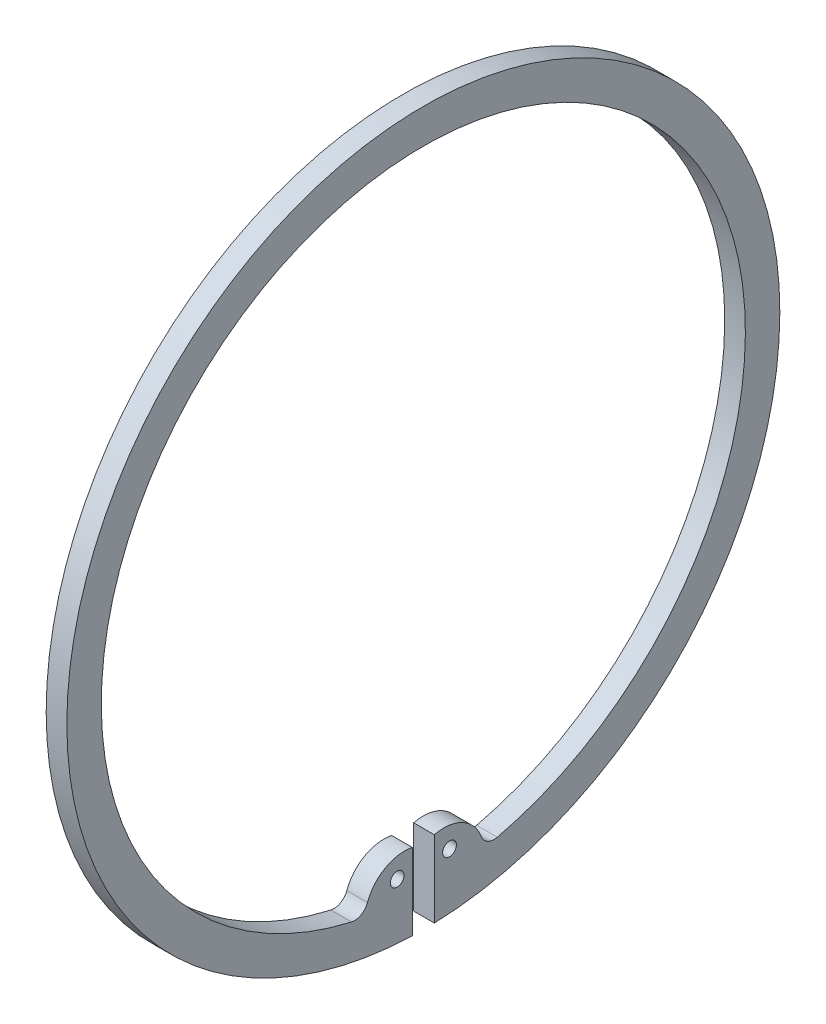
from build123d import *

# Parameters (mm, degrees)
ESQUISSE1_R          = 1
BASE_EXTRUSION_DEPTH = 3


with BuildPart() as part:
    # Esquisse1 → Base-Extrusion (new body)
    with BuildSketch(Plane(origin=(0, 0, 0), x_dir=(0, 0, -1), z_dir=(1, 0, 0))):
        with BuildLine():
            Line((-1.6, -51.725259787), (-1.6, -40.609160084))
            ThreePointArc((-1.6, -40.609160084), (-5.538478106, -41.242641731), (-8.107128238, -44.29468126))
            ThreePointArc((-8.107128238, -44.29468126), (-9.029600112, -45.374888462), (-10.436607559, -45.570162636))
            ThreePointArc((-10.436607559, -45.570162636), (-0.156480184, 46.749738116), (10.741434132, -45.499275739))
            ThreePointArc((10.741434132, -45.499275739), (9.333414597, -45.313566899), (8.403674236, -44.239979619))
            ThreePointArc((8.403674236, -44.239979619), (5.694761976, -41.127333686), (1.6, -40.617731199))
            Line((1.6, -40.617731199), (1.6, -51.725259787))
            ThreePointArc((1.6, -51.725259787), (0, 51.75), (-1.6, -51.725259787))
        make_face()
        with Locations(Location((-3.8, -43.5, 0), (0, 0, 180))):
            Circle(ESQUISSE1_R, mode=Mode.SUBTRACT)
        with Locations(Location((3.8, -43.5, 0), (0, 0, 180))):
            Circle(ESQUISSE1_R, mode=Mode.SUBTRACT)
    extrude(amount=BASE_EXTRUSION_DEPTH)


solid = part.part
